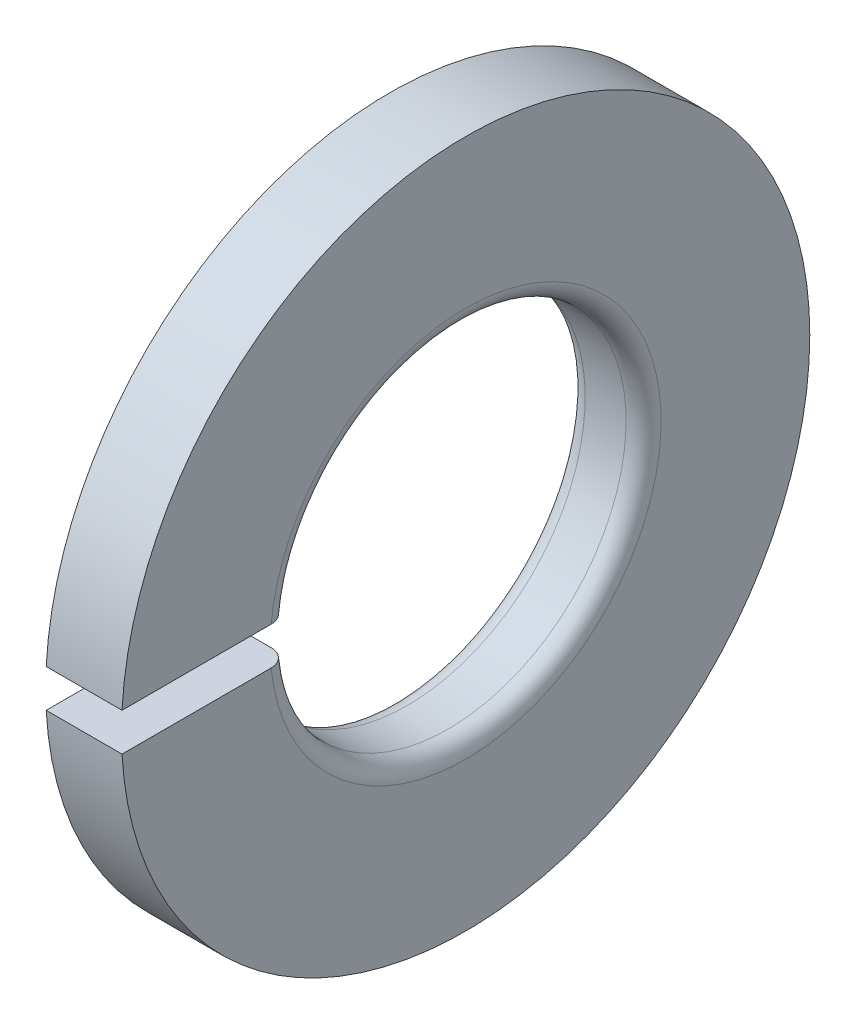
ISO-10303-21;
HEADER;
FILE_DESCRIPTION(('STEP AP214'),'2;1');
FILE_NAME('part.step','',(''),(''),'','','');
FILE_SCHEMA(('AUTOMOTIVE_DESIGN { 1 0 10303 214 1 1 1 1 }'));
ENDSEC;
DATA;
#1=APPLICATION_CONTEXT('core data for automotive mechanical design processes');
#2=APPLICATION_PROTOCOL_DEFINITION('international standard','automotive_design',2000,#1);
#3=PRODUCT_CONTEXT('',#1,'mechanical');
#4=PRODUCT('Part','Part','',(#3));
#5=PRODUCT_RELATED_PRODUCT_CATEGORY('part','',(#4));
#6=PRODUCT_DEFINITION_FORMATION('','',#4);
#7=PRODUCT_DEFINITION_CONTEXT('part definition',#1,'design');
#8=PRODUCT_DEFINITION('design','',#6,#7);
#9=PRODUCT_DEFINITION_SHAPE('','',#8);
#10=(LENGTH_UNIT() NAMED_UNIT(*) SI_UNIT(.MILLI.,.METRE.));
#11=(NAMED_UNIT(*) PLANE_ANGLE_UNIT() SI_UNIT($,.RADIAN.));
#12=(NAMED_UNIT(*) SI_UNIT($,.STERADIAN.) SOLID_ANGLE_UNIT());
#13=UNCERTAINTY_MEASURE_WITH_UNIT(LENGTH_MEASURE(1.E-05),#10,'distance_accuracy_value','');
#14=(GEOMETRIC_REPRESENTATION_CONTEXT(3) GLOBAL_UNCERTAINTY_ASSIGNED_CONTEXT((#13)) GLOBAL_UNIT_ASSIGNED_CONTEXT((#10,
#11,#12)) REPRESENTATION_CONTEXT('',''));
#15=CARTESIAN_POINT('',(0.,0.,0.));
#16=DIRECTION('',(0.,0.,1.));
#17=DIRECTION('',(1.,0.,0.));
#18=AXIS2_PLACEMENT_3D('',#15,#16,#17);
#19=CARTESIAN_POINT('',(-34.9249999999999,0.,0.));
#20=DIRECTION('',(-1.,0.,0.));
#21=DIRECTION('',(0.,0.,1.));
#22=AXIS2_PLACEMENT_3D('',#19,#20,#21);
#23=CYLINDRICAL_SURFACE('',#22,5.9);
#24=DIRECTION('',(-1.,0.,0.));
#25=VECTOR('',#24,1.);
#26=CARTESIAN_POINT('',(-34.925,0.325000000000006,5.89104192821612));
#27=LINE('',#26,#25);
#28=CARTESIAN_POINT('',(0.,0.324999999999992,5.89104192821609));
#29=VERTEX_POINT('',#28);
#30=CARTESIAN_POINT('',(-1.30000000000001,0.325000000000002,5.89104192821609));
#31=VERTEX_POINT('',#30);
#32=EDGE_CURVE('E44',#29,#31,#27,.T.);
#33=ORIENTED_EDGE('',*,*,#32,.F.);
#34=CARTESIAN_POINT('',(0.,0.,0.));
#35=DIRECTION('',(-1.,0.,0.));
#36=DIRECTION('',(0.,0.,1.));
#37=AXIS2_PLACEMENT_3D('',#34,#35,#36);
#38=CIRCLE('',#37,5.9);
#39=CARTESIAN_POINT('',(0.,-0.324999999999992,5.89104192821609));
#40=VERTEX_POINT('',#39);
#41=EDGE_CURVE('E105',#29,#40,#38,.T.);
#42=ORIENTED_EDGE('',*,*,#41,.T.);
#43=DIRECTION('',(-1.,0.,0.));
#44=VECTOR('',#43,1.);
#45=CARTESIAN_POINT('',(-34.925,-0.324999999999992,5.89104192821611));
#46=LINE('',#45,#44);
#47=CARTESIAN_POINT('',(-1.30000000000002,-0.325000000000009,5.89104192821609));
#48=VERTEX_POINT('',#47);
#49=EDGE_CURVE('E86',#48,#40,#46,.F.);
#50=ORIENTED_EDGE('',*,*,#49,.F.);
#51=CARTESIAN_POINT('',(-1.3,0.,0.));
#52=DIRECTION('',(-1.,0.,0.));
#53=DIRECTION('',(0.,0.,1.));
#54=AXIS2_PLACEMENT_3D('',#51,#52,#53);
#55=CIRCLE('',#54,5.9);
#56=EDGE_CURVE('E117',#31,#48,#55,.T.);
#57=ORIENTED_EDGE('',*,*,#56,.F.);
#58=EDGE_LOOP('',(#33,#42,#50,#57));
#59=FACE_BOUND('',#58,.T.);
#60=ADVANCED_FACE('F31',(#59),#23,.T.);
#61=CARTESIAN_POINT('',(0.,3.34999999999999,0.));
#62=DIRECTION('',(-1.,0.,0.));
#63=DIRECTION('',(0.,0.,1.));
#64=AXIS2_PLACEMENT_3D('',#61,#62,#63);
#65=PLANE('',#64);
#66=DIRECTION('',(0.,0.,-1.));
#67=VECTOR('',#66,1.);
#68=CARTESIAN_POINT('',(0.,0.324999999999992,6.018));
#69=LINE('',#68,#67);
#70=CARTESIAN_POINT('',(0.,0.324999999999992,3.33419780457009));
#71=VERTEX_POINT('',#70);
#72=EDGE_CURVE('E91',#29,#71,#69,.T.);
#73=ORIENTED_EDGE('',*,*,#72,.T.);
#74=CARTESIAN_POINT('',(0.,0.,0.));
#75=DIRECTION('',(-1.,0.,0.));
#76=DIRECTION('',(0.,0.,1.));
#77=AXIS2_PLACEMENT_3D('',#74,#75,#76);
#78=CIRCLE('',#77,3.35);
#79=CARTESIAN_POINT('',(0.,-0.325000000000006,3.33419780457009));
#80=VERTEX_POINT('',#79);
#81=EDGE_CURVE('E98',#71,#80,#78,.T.);
#82=ORIENTED_EDGE('',*,*,#81,.T.);
#83=DIRECTION('',(0.,0.,1.));
#84=VECTOR('',#83,1.);
#85=CARTESIAN_POINT('',(0.,-0.324999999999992,0.));
#86=LINE('',#85,#84);
#87=EDGE_CURVE('E80',#80,#40,#86,.T.);
#88=ORIENTED_EDGE('',*,*,#87,.T.);
#89=ORIENTED_EDGE('',*,*,#41,.F.);
#90=EDGE_LOOP('',(#73,#82,#88,#89));
#91=FACE_BOUND('',#90,.T.);
#92=ADVANCED_FACE('F104',(#91),#65,.F.);
#93=CARTESIAN_POINT('',(-0.300000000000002,0.,0.));
#94=DIRECTION('',(-1.,0.,0.));
#95=DIRECTION('',(0.,0.,1.));
#96=AXIS2_PLACEMENT_3D('',#93,#94,#95);
#97=TOROIDAL_SURFACE('',#96,3.35,0.3);
#98=ORIENTED_EDGE('',*,*,#81,.F.);
#99=CARTESIAN_POINT('',(-0.164784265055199,0.324999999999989,3.06501768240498));
#100=CARTESIAN_POINT('',(-0.179742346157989,0.324999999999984,3.05742363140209));
#101=CARTESIAN_POINT('',(-0.195350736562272,0.325000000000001,3.05108422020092));
#102=CARTESIAN_POINT('',(-0.227422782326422,0.325000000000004,3.04111000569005));
#103=CARTESIAN_POINT('',(-0.243887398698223,0.32499999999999,3.03747831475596));
#104=CARTESIAN_POINT('',(-0.277188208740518,0.324999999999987,3.03303503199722));
#105=CARTESIAN_POINT('',(-0.294024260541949,0.324999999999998,3.03222238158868));
#106=CARTESIAN_POINT('',(-0.327588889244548,0.325000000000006,3.03343923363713));
#107=CARTESIAN_POINT('',(-0.344317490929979,0.325000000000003,3.03546805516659));
#108=CARTESIAN_POINT('',(-0.377179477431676,0.325000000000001,3.0423029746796));
#109=CARTESIAN_POINT('',(-0.393313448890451,0.325000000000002,3.04710625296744));
#110=CARTESIAN_POINT('',(-0.42454921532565,0.325000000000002,3.05934757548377));
#111=CARTESIAN_POINT('',(-0.439650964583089,0.325000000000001,3.06678573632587));
#112=CARTESIAN_POINT('',(-0.468430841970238,0.325000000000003,3.08410032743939));
#113=CARTESIAN_POINT('',(-0.482105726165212,0.325000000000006,3.09398214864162));
#114=CARTESIAN_POINT('',(-0.507612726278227,0.324999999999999,3.11589092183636));
#115=CARTESIAN_POINT('',(-0.519444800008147,0.324999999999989,3.12791792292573));
#116=CARTESIAN_POINT('',(-0.540992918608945,0.324999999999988,3.15383855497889));
#117=CARTESIAN_POINT('',(-0.550698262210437,0.324999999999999,3.16774108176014));
#118=CARTESIAN_POINT('',(-0.56765078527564,0.325000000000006,3.19697169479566));
#119=CARTESIAN_POINT('',(-0.574897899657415,0.325000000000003,3.21229981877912));
#120=CARTESIAN_POINT('',(-0.586764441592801,0.325000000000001,3.24402866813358));
#121=CARTESIAN_POINT('',(-0.591370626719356,0.325000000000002,3.2604343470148));
#122=CARTESIAN_POINT('',(-0.597771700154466,0.325000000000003,3.29378538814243));
#123=CARTESIAN_POINT('',(-0.599566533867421,0.325000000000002,3.31073076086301));
#124=CARTESIAN_POINT('',(-0.600295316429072,0.325000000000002,3.34472882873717));
#125=CARTESIAN_POINT('',(-0.599221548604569,0.325000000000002,3.36178169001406));
#126=CARTESIAN_POINT('',(-0.594225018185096,0.325000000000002,3.39546495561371));
#127=CARTESIAN_POINT('',(-0.590302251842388,0.325000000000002,3.41209535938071));
#128=CARTESIAN_POINT('',(-0.579718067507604,0.325000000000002,3.44445169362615));
#129=CARTESIAN_POINT('',(-0.573058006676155,0.325000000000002,3.46017806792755));
#130=CARTESIAN_POINT('',(-0.557184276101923,0.325000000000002,3.49028461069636));
#131=CARTESIAN_POINT('',(-0.547970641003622,0.325000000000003,3.50466479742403));
#132=CARTESIAN_POINT('',(-0.527280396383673,0.325000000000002,3.53162248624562));
#133=CARTESIAN_POINT('',(-0.515810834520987,0.325000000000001,3.5442053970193));
#134=CARTESIAN_POINT('',(-0.490914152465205,0.325000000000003,3.56725714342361));
#135=CARTESIAN_POINT('',(-0.477487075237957,0.325000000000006,3.57772602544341));
#136=CARTESIAN_POINT('',(-0.449116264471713,0.325000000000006,3.59620651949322));
#137=CARTESIAN_POINT('',(-0.43417905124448,0.325000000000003,3.60422814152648));
#138=CARTESIAN_POINT('',(-0.403166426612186,0.325000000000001,3.61763942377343));
#139=CARTESIAN_POINT('',(-0.387091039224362,0.325000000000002,3.62302913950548));
#140=CARTESIAN_POINT('',(-0.354320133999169,0.325000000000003,3.63100501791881));
#141=CARTESIAN_POINT('',(-0.337627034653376,0.325000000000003,3.63360111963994));
#142=CARTESIAN_POINT('',(-0.304042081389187,0.325000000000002,3.63594848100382));
#143=CARTESIAN_POINT('',(-0.287150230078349,0.325000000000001,3.63569977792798));
#144=CARTESIAN_POINT('',(-0.25367856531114,0.325000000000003,3.63236778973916));
#145=CARTESIAN_POINT('',(-0.237098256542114,0.325000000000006,3.62928947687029));
#146=CARTESIAN_POINT('',(-0.204689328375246,0.324999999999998,3.62039456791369));
#147=CARTESIAN_POINT('',(-0.188860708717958,0.324999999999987,3.6145779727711));
#148=CARTESIAN_POINT('',(-0.158392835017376,0.32499999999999,3.6003700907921));
#149=CARTESIAN_POINT('',(-0.143754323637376,0.325000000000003,3.59197721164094));
#150=CARTESIAN_POINT('',(-0.116089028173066,0.325000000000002,3.57285944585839));
#151=CARTESIAN_POINT('',(-0.103062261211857,0.324999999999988,3.56213453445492));
#152=CARTESIAN_POINT('',(-0.0789502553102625,0.324999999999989,3.53862634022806));
#153=CARTESIAN_POINT('',(-0.0678705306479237,0.325000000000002,3.52583740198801));
#154=CARTESIAN_POINT('',(-0.0480051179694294,0.325000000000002,3.49858727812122));
#155=CARTESIAN_POINT('',(-0.0392194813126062,0.324999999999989,3.48412605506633));
#156=CARTESIAN_POINT('',(-0.024153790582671,0.324999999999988,3.45387956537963));
#157=CARTESIAN_POINT('',(-0.0178839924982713,0.325000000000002,3.43808919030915));
#158=CARTESIAN_POINT('',(-0.00807297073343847,0.325000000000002,3.40568235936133));
#159=CARTESIAN_POINT('',(-0.00453181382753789,0.324999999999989,3.38906588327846));
#160=CARTESIAN_POINT('',(-0.000266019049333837,0.324999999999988,3.35541030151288));
#161=CARTESIAN_POINT('',(0.00044775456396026,0.325000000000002,3.33836981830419));
#162=CARTESIAN_POINT('',(-0.000989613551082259,0.325000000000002,3.3044106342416));
#163=CARTESIAN_POINT('',(-0.00314068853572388,0.324999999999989,3.28749193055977));
#164=CARTESIAN_POINT('',(-0.0102538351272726,0.324999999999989,3.25422315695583));
#165=CARTESIAN_POINT('',(-0.0152211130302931,0.325000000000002,3.23787419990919));
#166=CARTESIAN_POINT('',(-0.0278343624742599,0.325000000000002,3.2062390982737));
#167=CARTESIAN_POINT('',(-0.0354809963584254,0.324999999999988,3.1909532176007));
#168=CARTESIAN_POINT('',(-0.0532322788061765,0.324999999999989,3.16189667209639));
#169=CARTESIAN_POINT('',(-0.0633354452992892,0.325000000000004,3.14812510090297));
#170=CARTESIAN_POINT('',(-0.0857124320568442,0.325000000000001,3.12249558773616));
#171=CARTESIAN_POINT('',(-0.0979835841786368,0.324999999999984,3.11063532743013));
#172=CARTESIAN_POINT('',(-0.119442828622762,0.324999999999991,3.09315407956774));
#173=CARTESIAN_POINT('',(-0.128084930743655,0.325000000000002,3.08685111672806));
#174=CARTESIAN_POINT('',(-0.145991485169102,0.325000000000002,3.07520163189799));
#175=CARTESIAN_POINT('',(-0.155255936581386,0.324999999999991,3.06985510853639));
#176=CARTESIAN_POINT('',(-0.164784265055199,0.324999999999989,3.06501768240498));
#177=B_SPLINE_CURVE_WITH_KNOTS('',3,(#99,#100,#101,#102,#103,#104,#105,#106,#107,#108,#109,#110,
#111,#112,#113,#114,#115,#116,#117,#118,#119,#120,#121,#122,#123,#124,#125,#126,#127,#128,#129,
#130,#131,#132,#133,#134,#135,#136,#137,#138,#139,#140,#141,#142,#143,#144,#145,#146,#147,#148,
#149,#150,#151,#152,#153,#154,#155,#156,#157,#158,#159,#160,#161,#162,#163,#164,#165,#166,#167,
#168,#169,#170,#171,#172,#173,#174,#175,#176),.UNSPECIFIED.,.T.,.F.,(4,2,2,2,2,2,2,2,2,2,2,2,2,
2,2,2,2,2,2,2,2,2,2,2,2,2,2,2,2,2,2,2,2,2,2,2,2,2,4),(0.,0.0502873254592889,0.100632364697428,
0.150958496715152,0.201272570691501,0.251535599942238,0.301800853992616,0.352178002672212,
0.402556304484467,0.453182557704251,0.50381015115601,0.554689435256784,0.60556970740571,
0.656586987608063,0.707604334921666,0.75859641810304,0.8095878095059,0.860422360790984,
0.911255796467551,0.961878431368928,1.01249999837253,1.06294086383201,1.11338106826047,
1.16373280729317,1.21408452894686,1.2644674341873,1.31485087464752,1.36537478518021,
1.41589982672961,1.46662879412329,1.51735900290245,1.56828395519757,1.61920772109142,
1.67022593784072,1.72125677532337,1.77225690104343,1.82319469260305,1.85522786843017,
1.88726099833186),.UNSPECIFIED.);
#178=CARTESIAN_POINT('',(-0.300000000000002,0.325000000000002,3.03263499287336));
#179=VERTEX_POINT('',#178);
#180=EDGE_CURVE('E124',#71,#179,#177,.T.);
#181=ORIENTED_EDGE('',*,*,#180,.T.);
#182=CARTESIAN_POINT('',(-0.300000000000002,0.,0.));
#183=DIRECTION('',(-1.,0.,0.));
#184=DIRECTION('',(0.,0.,1.));
#185=AXIS2_PLACEMENT_3D('',#182,#183,#184);
#186=CIRCLE('',#185,3.05);
#187=CARTESIAN_POINT('',(-0.300000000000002,-0.325000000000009,3.03263499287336));
#188=VERTEX_POINT('',#187);
#189=EDGE_CURVE('E100',#179,#188,#186,.T.);
#190=ORIENTED_EDGE('',*,*,#189,.T.);
#191=CARTESIAN_POINT('',(-0.164784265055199,-0.325000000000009,3.06501768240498));
#192=CARTESIAN_POINT('',(-0.149728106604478,-0.325000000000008,3.07266322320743));
#193=CARTESIAN_POINT('',(-0.135308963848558,-0.32500000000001,3.08159122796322));
#194=CARTESIAN_POINT('',(-0.108165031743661,-0.325000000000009,3.10175231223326));
#195=CARTESIAN_POINT('',(-0.095442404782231,-0.325000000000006,3.11298828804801));
#196=CARTESIAN_POINT('',(-0.0720695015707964,-0.325000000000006,3.13742740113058));
#197=CARTESIAN_POINT('',(-0.0614177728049,-0.325000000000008,3.15062914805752));
#198=CARTESIAN_POINT('',(-0.0424750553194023,-0.32500000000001,3.17862396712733));
#199=CARTESIAN_POINT('',(-0.0341834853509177,-0.32500000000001,3.19341664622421));
#200=CARTESIAN_POINT('',(-0.0201577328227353,-0.325000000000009,3.22423781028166));
#201=CARTESIAN_POINT('',(-0.0144335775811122,-0.325000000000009,3.24027085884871));
#202=CARTESIAN_POINT('',(-0.00574796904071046,-0.325000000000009,3.27306934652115));
#203=CARTESIAN_POINT('',(-0.00278668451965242,-0.325000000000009,3.28983483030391));
#204=CARTESIAN_POINT('',(0.000295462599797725,-0.325000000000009,3.3236805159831));
#205=CARTESIAN_POINT('',(0.000406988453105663,-0.32500000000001,3.34076156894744));
#206=CARTESIAN_POINT('',(-0.00223854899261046,-0.325000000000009,3.37470019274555));
#207=CARTESIAN_POINT('',(-0.00499562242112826,-0.325000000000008,3.39155776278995));
#208=CARTESIAN_POINT('',(-0.0133039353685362,-0.32500000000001,3.42457275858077));
#209=CARTESIAN_POINT('',(-0.0188556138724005,-0.325000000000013,3.44073007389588));
#210=CARTESIAN_POINT('',(-0.0325998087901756,-0.325000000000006,3.4718796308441));
#211=CARTESIAN_POINT('',(-0.0407922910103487,-0.324999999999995,3.48687188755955));
#212=CARTESIAN_POINT('',(-0.0595639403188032,-0.324999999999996,3.51522217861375));
#213=CARTESIAN_POINT('',(-0.0701367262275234,-0.325000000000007,3.52858443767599));
#214=CARTESIAN_POINT('',(-0.0933839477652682,-0.325000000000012,3.55333516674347));
#215=CARTESIAN_POINT('',(-0.106058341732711,-0.325000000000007,3.56472367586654));
#216=CARTESIAN_POINT('',(-0.133093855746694,-0.325000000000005,3.58515414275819));
#217=CARTESIAN_POINT('',(-0.147447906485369,-0.325000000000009,3.59420545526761));
#218=CARTESIAN_POINT('',(-0.177476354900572,-0.32500000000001,3.60975901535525));
#219=CARTESIAN_POINT('',(-0.193150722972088,-0.325000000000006,3.61626132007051));
#220=CARTESIAN_POINT('',(-0.225310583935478,-0.325000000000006,3.62650750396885));
#221=CARTESIAN_POINT('',(-0.241792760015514,-0.325000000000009,3.63026179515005));
#222=CARTESIAN_POINT('',(-0.275153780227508,-0.325000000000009,3.63494317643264));
#223=CARTESIAN_POINT('',(-0.292032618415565,-0.325000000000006,3.63587030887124));
#224=CARTESIAN_POINT('',(-0.325668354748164,-0.325000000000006,3.63487154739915));
#225=CARTESIAN_POINT('',(-0.342425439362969,-0.325000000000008,3.63295191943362));
#226=CARTESIAN_POINT('',(-0.375379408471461,-0.32500000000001,3.626326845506));
#227=CARTESIAN_POINT('',(-0.391576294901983,-0.32500000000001,3.62162140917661));
#228=CARTESIAN_POINT('',(-0.422953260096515,-0.325000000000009,3.60956017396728));
#229=CARTESIAN_POINT('',(-0.438133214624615,-0.325000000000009,3.60220405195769));
#230=CARTESIAN_POINT('',(-0.467046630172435,-0.325000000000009,3.5850535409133));
#231=CARTESIAN_POINT('',(-0.480780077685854,-0.325000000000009,3.57525912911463));
#232=CARTESIAN_POINT('',(-0.506447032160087,-0.325000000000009,3.55348642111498));
#233=CARTESIAN_POINT('',(-0.518376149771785,-0.325000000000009,3.54150295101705));
#234=CARTESIAN_POINT('',(-0.540062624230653,-0.325000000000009,3.51571018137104));
#235=CARTESIAN_POINT('',(-0.549819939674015,-0.325000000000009,3.50190084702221));
#236=CARTESIAN_POINT('',(-0.566926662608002,-0.325000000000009,3.47279122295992));
#237=CARTESIAN_POINT('',(-0.574266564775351,-0.32500000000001,3.45748534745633));
#238=CARTESIAN_POINT('',(-0.586284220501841,-0.325000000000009,3.42586195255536));
#239=CARTESIAN_POINT('',(-0.59096191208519,-0.325000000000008,3.40954440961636));
#240=CARTESIAN_POINT('',(-0.597540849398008,-0.32500000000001,3.37629092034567));
#241=CARTESIAN_POINT('',(-0.599430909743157,-0.325000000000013,3.35935276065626));
#242=CARTESIAN_POINT('',(-0.600348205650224,-0.325000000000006,3.32539902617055));
#243=CARTESIAN_POINT('',(-0.599375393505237,-0.324999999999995,3.30838345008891));
#244=CARTESIAN_POINT('',(-0.594588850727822,-0.324999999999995,3.27471364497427));
#245=CARTESIAN_POINT('',(-0.590768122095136,-0.325000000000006,3.25806041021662));
#246=CARTESIAN_POINT('',(-0.580384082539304,-0.325000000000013,3.22563190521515));
#247=CARTESIAN_POINT('',(-0.573820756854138,-0.325000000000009,3.20985663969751));
#248=CARTESIAN_POINT('',(-0.558137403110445,-0.325000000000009,3.17964068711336));
#249=CARTESIAN_POINT('',(-0.549018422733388,-0.325000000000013,3.16519945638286));
#250=CARTESIAN_POINT('',(-0.528477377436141,-0.325000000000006,3.13805980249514));
#251=CARTESIAN_POINT('',(-0.517055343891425,-0.324999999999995,3.12536135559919));
#252=CARTESIAN_POINT('',(-0.492273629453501,-0.324999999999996,3.1021172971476));
#253=CARTESIAN_POINT('',(-0.478920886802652,-0.325000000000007,3.09156428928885));
#254=CARTESIAN_POINT('',(-0.450625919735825,-0.325000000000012,3.07286429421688));
#255=CARTESIAN_POINT('',(-0.435683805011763,-0.325000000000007,3.06471714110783));
#256=CARTESIAN_POINT('',(-0.404719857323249,-0.325000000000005,3.05110556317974));
#257=CARTESIAN_POINT('',(-0.388704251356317,-0.325000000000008,3.04562697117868));
#258=CARTESIAN_POINT('',(-0.355973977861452,-0.32500000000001,3.03744845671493));
#259=CARTESIAN_POINT('',(-0.339259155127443,-0.325000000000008,3.03474915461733));
#260=CARTESIAN_POINT('',(-0.305680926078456,-0.32500000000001,3.03221585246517));
#261=CARTESIAN_POINT('',(-0.288818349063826,-0.325000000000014,3.03237076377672));
#262=CARTESIAN_POINT('',(-0.25537394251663,-0.325000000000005,3.03551516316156));
#263=CARTESIAN_POINT('',(-0.23879179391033,-0.324999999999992,3.03850117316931));
#264=CARTESIAN_POINT('',(-0.212603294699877,-0.324999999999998,3.04553409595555));
#265=CARTESIAN_POINT('',(-0.202761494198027,-0.325000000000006,3.04873441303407));
#266=CARTESIAN_POINT('',(-0.183461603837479,-0.325000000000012,3.05613543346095));
#267=CARTESIAN_POINT('',(-0.174003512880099,-0.32500000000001,3.06033613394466));
#268=CARTESIAN_POINT('',(-0.164784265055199,-0.325000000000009,3.06501768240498));
#269=B_SPLINE_CURVE_WITH_KNOTS('',3,(#191,#192,#193,#194,#195,#196,#197,#198,#199,#200,#201,
#202,#203,#204,#205,#206,#207,#208,#209,#210,#211,#212,#213,#214,#215,#216,#217,#218,#219,#220,
#221,#222,#223,#224,#225,#226,#227,#228,#229,#230,#231,#232,#233,#234,#235,#236,#237,#238,#239,
#240,#241,#242,#243,#244,#245,#246,#247,#248,#249,#250,#251,#252,#253,#254,#255,#256,#257,#258,
#259,#260,#261,#262,#263,#264,#265,#266,#267,#268),.UNSPECIFIED.,.T.,.F.,(4,2,2,2,2,2,2,2,2,2,2,
2,2,2,2,2,2,2,2,2,2,2,2,2,2,2,2,2,2,2,2,2,2,2,2,2,2,2,4),(0.,0.0506204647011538,
0.101304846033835,0.151953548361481,0.202589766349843,0.253422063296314,0.304257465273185,
0.355259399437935,0.406261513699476,0.457271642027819,0.508281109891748,0.559155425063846,
0.610028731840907,0.660695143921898,0.71136042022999,0.761832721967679,0.81230426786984,
0.862664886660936,0.913025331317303,0.963391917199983,1.01375897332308,1.0642466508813,
1.11473529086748,1.1654201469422,1.21610618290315,1.26699504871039,1.31788476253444,
1.36889993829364,1.4199153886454,1.47090995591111,1.52190382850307,1.57271880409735,
1.62353027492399,1.67406896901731,1.72461894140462,1.77497256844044,1.82526441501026,
1.85626063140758,1.88725675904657),.UNSPECIFIED.);
#270=EDGE_CURVE('E83',#188,#80,#269,.T.);
#271=ORIENTED_EDGE('',*,*,#270,.T.);
#272=EDGE_LOOP('',(#98,#181,#190,#271));
#273=FACE_BOUND('',#272,.T.);
#274=ADVANCED_FACE('F96',(#273),#97,.T.);
#275=CARTESIAN_POINT('',(-34.9249999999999,0.,0.));
#276=DIRECTION('',(-1.,0.,0.));
#277=DIRECTION('',(0.,0.,1.));
#278=AXIS2_PLACEMENT_3D('',#275,#276,#277);
#279=CYLINDRICAL_SURFACE('',#278,3.05);
#280=DIRECTION('',(-1.,0.,0.));
#281=VECTOR('',#280,1.);
#282=CARTESIAN_POINT('',(-34.9249999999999,0.325000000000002,3.03263499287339));
#283=LINE('',#282,#281);
#284=CARTESIAN_POINT('',(-0.999999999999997,0.325000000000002,3.03263499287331));
#285=VERTEX_POINT('',#284);
#286=EDGE_CURVE('E132',#285,#179,#283,.F.);
#287=ORIENTED_EDGE('',*,*,#286,.F.);
#288=CARTESIAN_POINT('',(-1.,0.,0.));
#289=DIRECTION('',(-1.,0.,0.));
#290=DIRECTION('',(0.,0.,1.));
#291=AXIS2_PLACEMENT_3D('',#288,#289,#290);
#292=CIRCLE('',#291,3.05);
#293=CARTESIAN_POINT('',(-1.0000000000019,-0.324999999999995,3.0326349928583));
#294=VERTEX_POINT('',#293);
#295=EDGE_CURVE('E108',#285,#294,#292,.T.);
#296=ORIENTED_EDGE('',*,*,#295,.T.);
#297=DIRECTION('',(-1.,0.,0.));
#298=VECTOR('',#297,1.);
#299=CARTESIAN_POINT('',(-34.925,-0.324999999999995,3.03263499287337));
#300=LINE('',#299,#298);
#301=EDGE_CURVE('E101',#188,#294,#300,.T.);
#302=ORIENTED_EDGE('',*,*,#301,.F.);
#303=ORIENTED_EDGE('',*,*,#189,.F.);
#304=EDGE_LOOP('',(#287,#296,#302,#303));
#305=FACE_BOUND('',#304,.T.);
#306=ADVANCED_FACE('F131',(#305),#279,.F.);
#307=CARTESIAN_POINT('',(-1.,0.,0.));
#308=DIRECTION('',(-1.,0.,0.));
#309=DIRECTION('',(0.,0.,1.));
#310=AXIS2_PLACEMENT_3D('',#307,#308,#309);
#311=TOROIDAL_SURFACE('',#310,3.35,0.3);
#312=ORIENTED_EDGE('',*,*,#295,.F.);
#313=CARTESIAN_POINT('',(-1.1352157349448,0.325000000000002,3.06501768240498));
#314=CARTESIAN_POINT('',(-1.15027189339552,0.325000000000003,3.07266322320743));
#315=CARTESIAN_POINT('',(-1.16469103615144,0.325000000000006,3.08159122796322));
#316=CARTESIAN_POINT('',(-1.19183496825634,0.324999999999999,3.10175231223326));
#317=CARTESIAN_POINT('',(-1.20455759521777,0.324999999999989,3.11298828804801));
#318=CARTESIAN_POINT('',(-1.2279304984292,0.324999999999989,3.13742740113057));
#319=CARTESIAN_POINT('',(-1.2385822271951,0.324999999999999,3.15062914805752));
#320=CARTESIAN_POINT('',(-1.2575249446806,0.325000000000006,3.17862396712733));
#321=CARTESIAN_POINT('',(-1.26581651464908,0.325000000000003,3.19341664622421));
#322=CARTESIAN_POINT('',(-1.27984226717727,0.325000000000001,3.22423781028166));
#323=CARTESIAN_POINT('',(-1.28556642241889,0.325000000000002,3.24027085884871));
#324=CARTESIAN_POINT('',(-1.29425203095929,0.325000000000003,3.27306934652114));
#325=CARTESIAN_POINT('',(-1.29721331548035,0.325000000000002,3.28983483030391));
#326=CARTESIAN_POINT('',(-1.3002954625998,0.325000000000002,3.3236805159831));
#327=CARTESIAN_POINT('',(-1.30040698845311,0.325000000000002,3.34076156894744));
#328=CARTESIAN_POINT('',(-1.29776145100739,0.325000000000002,3.37470019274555));
#329=CARTESIAN_POINT('',(-1.29500437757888,0.325000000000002,3.39155776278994));
#330=CARTESIAN_POINT('',(-1.28669606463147,0.325000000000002,3.42457275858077));
#331=CARTESIAN_POINT('',(-1.2811443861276,0.325000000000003,3.44073007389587));
#332=CARTESIAN_POINT('',(-1.26740019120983,0.325000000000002,3.4718796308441));
#333=CARTESIAN_POINT('',(-1.25920770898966,0.325000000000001,3.48687188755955));
#334=CARTESIAN_POINT('',(-1.2404360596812,0.325000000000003,3.51522217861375));
#335=CARTESIAN_POINT('',(-1.22986327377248,0.325000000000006,3.52858443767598));
#336=CARTESIAN_POINT('',(-1.20661605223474,0.324999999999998,3.55333516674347));
#337=CARTESIAN_POINT('',(-1.19394165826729,0.324999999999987,3.56472367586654));
#338=CARTESIAN_POINT('',(-1.16690614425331,0.32499999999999,3.58515414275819));
#339=CARTESIAN_POINT('',(-1.15255209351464,0.325000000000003,3.59420545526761));
#340=CARTESIAN_POINT('',(-1.12252364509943,0.325000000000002,3.60975901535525));
#341=CARTESIAN_POINT('',(-1.10684927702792,0.324999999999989,3.61626132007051));
#342=CARTESIAN_POINT('',(-1.07468941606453,0.324999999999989,3.62650750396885));
#343=CARTESIAN_POINT('',(-1.05820723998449,0.325000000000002,3.63026179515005));
#344=CARTESIAN_POINT('',(-1.0248462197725,0.325000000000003,3.63494317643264));
#345=CARTESIAN_POINT('',(-1.00796738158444,0.32499999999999,3.63587030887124));
#346=CARTESIAN_POINT('',(-0.974331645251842,0.324999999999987,3.63487154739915));
#347=CARTESIAN_POINT('',(-0.957574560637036,0.324999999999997,3.63295191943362));
#348=CARTESIAN_POINT('',(-0.924620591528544,0.325000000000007,3.626326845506));
#349=CARTESIAN_POINT('',(-0.908423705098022,0.325000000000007,3.62162140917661));
#350=CARTESIAN_POINT('',(-0.877046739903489,0.325000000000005,3.60956017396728));
#351=CARTESIAN_POINT('',(-0.86186678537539,0.325000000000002,3.60220405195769));
#352=CARTESIAN_POINT('',(-0.832953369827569,0.325000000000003,3.58505354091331));
#353=CARTESIAN_POINT('',(-0.81921992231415,0.325000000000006,3.57525912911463));
#354=CARTESIAN_POINT('',(-0.793552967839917,0.325000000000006,3.55348642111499));
#355=CARTESIAN_POINT('',(-0.78162385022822,0.325000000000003,3.54150295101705));
#356=CARTESIAN_POINT('',(-0.759937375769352,0.325000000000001,3.51571018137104));
#357=CARTESIAN_POINT('',(-0.75018006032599,0.325000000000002,3.50190084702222));
#358=CARTESIAN_POINT('',(-0.733073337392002,0.325000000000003,3.47279122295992));
#359=CARTESIAN_POINT('',(-0.725733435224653,0.325000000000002,3.45748534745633));
#360=CARTESIAN_POINT('',(-0.713715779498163,0.325000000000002,3.42586195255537));
#361=CARTESIAN_POINT('',(-0.709038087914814,0.325000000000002,3.40954440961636));
#362=CARTESIAN_POINT('',(-0.702459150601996,0.325000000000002,3.37629092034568));
#363=CARTESIAN_POINT('',(-0.700569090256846,0.325000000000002,3.35935276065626));
#364=CARTESIAN_POINT('',(-0.699651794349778,0.325000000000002,3.32539902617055));
#365=CARTESIAN_POINT('',(-0.700624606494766,0.325000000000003,3.30838345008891));
#366=CARTESIAN_POINT('',(-0.70541114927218,0.325000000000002,3.27471364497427));
#367=CARTESIAN_POINT('',(-0.709231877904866,0.325000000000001,3.25806041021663));
#368=CARTESIAN_POINT('',(-0.719615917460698,0.325000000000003,3.22563190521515));
#369=CARTESIAN_POINT('',(-0.726179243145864,0.325000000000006,3.20985663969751));
#370=CARTESIAN_POINT('',(-0.741862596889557,0.325000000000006,3.17964068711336));
#371=CARTESIAN_POINT('',(-0.750981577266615,0.325000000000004,3.16519945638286));
#372=CARTESIAN_POINT('',(-0.771522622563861,0.325000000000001,3.13805980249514));
#373=CARTESIAN_POINT('',(-0.782944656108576,0.325000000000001,3.12536135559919));
#374=CARTESIAN_POINT('',(-0.807726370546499,0.325000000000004,3.1021172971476));
#375=CARTESIAN_POINT('',(-0.82107911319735,0.325000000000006,3.09156428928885));
#376=CARTESIAN_POINT('',(-0.849374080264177,0.324999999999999,3.07286429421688));
#377=CARTESIAN_POINT('',(-0.864316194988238,0.324999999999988,3.06471714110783));
#378=CARTESIAN_POINT('',(-0.895280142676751,0.324999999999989,3.05110556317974));
#379=CARTESIAN_POINT('',(-0.911295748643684,0.324999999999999,3.04562697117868));
#380=CARTESIAN_POINT('',(-0.944026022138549,0.325000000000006,3.03744845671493));
#381=CARTESIAN_POINT('',(-0.960740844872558,0.325000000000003,3.03474915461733));
#382=CARTESIAN_POINT('',(-0.994319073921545,0.325000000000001,3.03221585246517));
#383=CARTESIAN_POINT('',(-1.01118165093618,0.325000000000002,3.03237076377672));
#384=CARTESIAN_POINT('',(-1.04462605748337,0.325000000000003,3.03551516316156));
#385=CARTESIAN_POINT('',(-1.06120820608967,0.325000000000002,3.03850117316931));
#386=CARTESIAN_POINT('',(-1.08739670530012,0.325000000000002,3.04553409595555));
#387=CARTESIAN_POINT('',(-1.09723850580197,0.325000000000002,3.04873441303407));
#388=CARTESIAN_POINT('',(-1.11653839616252,0.325000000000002,3.05613543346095));
#389=CARTESIAN_POINT('',(-1.1259964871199,0.325000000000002,3.06033613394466));
#390=CARTESIAN_POINT('',(-1.1352157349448,0.325000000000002,3.06501768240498));
#391=B_SPLINE_CURVE_WITH_KNOTS('',3,(#313,#314,#315,#316,#317,#318,#319,#320,#321,#322,#323,
#324,#325,#326,#327,#328,#329,#330,#331,#332,#333,#334,#335,#336,#337,#338,#339,#340,#341,#342,
#343,#344,#345,#346,#347,#348,#349,#350,#351,#352,#353,#354,#355,#356,#357,#358,#359,#360,#361,
#362,#363,#364,#365,#366,#367,#368,#369,#370,#371,#372,#373,#374,#375,#376,#377,#378,#379,#380,
#381,#382,#383,#384,#385,#386,#387,#388,#389,#390),.UNSPECIFIED.,.T.,.F.,(4,2,2,2,2,2,2,2,2,2,2,
2,2,2,2,2,2,2,2,2,2,2,2,2,2,2,2,2,2,2,2,2,2,2,2,2,2,2,4),(0.,0.0506204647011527,
0.101304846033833,0.151953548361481,0.202589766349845,0.253422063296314,0.304257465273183,
0.355259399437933,0.406261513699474,0.457271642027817,0.508281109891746,0.559155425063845,
0.610028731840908,0.660695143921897,0.711360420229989,0.761832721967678,0.812304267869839,
0.862664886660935,0.913025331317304,0.963391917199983,1.01375897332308,1.0642466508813,
1.11473529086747,1.1654201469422,1.21610618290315,1.26699504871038,1.31788476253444,
1.36889993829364,1.41991538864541,1.47090995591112,1.52190382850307,1.57271880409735,
1.62353027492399,1.67406896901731,1.72461894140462,1.77497256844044,1.82526441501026,
1.85626063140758,1.88725675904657),.UNSPECIFIED.);
#392=CARTESIAN_POINT('',(-1.3,0.324999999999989,3.33419780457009));
#393=VERTEX_POINT('',#392);
#394=EDGE_CURVE('E118',#285,#393,#391,.T.);
#395=ORIENTED_EDGE('',*,*,#394,.T.);
#396=CARTESIAN_POINT('',(-1.3,0.,0.));
#397=DIRECTION('',(-1.,0.,0.));
#398=DIRECTION('',(0.,0.,1.));
#399=AXIS2_PLACEMENT_3D('',#396,#397,#398);
#400=CIRCLE('',#399,3.35);
#401=CARTESIAN_POINT('',(-1.3,-0.325000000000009,3.33419780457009));
#402=VERTEX_POINT('',#401);
#403=EDGE_CURVE('E121',#393,#402,#400,.T.);
#404=ORIENTED_EDGE('',*,*,#403,.T.);
#405=CARTESIAN_POINT('',(-1.1352157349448,-0.324999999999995,3.06501768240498));
#406=CARTESIAN_POINT('',(-1.12025765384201,-0.324999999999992,3.05742363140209));
#407=CARTESIAN_POINT('',(-1.10464926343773,-0.325000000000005,3.05108422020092));
#408=CARTESIAN_POINT('',(-1.07257721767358,-0.325000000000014,3.04111000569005));
#409=CARTESIAN_POINT('',(-1.05611260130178,-0.325000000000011,3.03747831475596));
#410=CARTESIAN_POINT('',(-1.02281179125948,-0.325000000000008,3.03303503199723));
#411=CARTESIAN_POINT('',(-1.00597573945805,-0.325000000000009,3.03222238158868));
#412=CARTESIAN_POINT('',(-0.972411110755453,-0.32500000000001,3.03343923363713));
#413=CARTESIAN_POINT('',(-0.955682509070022,-0.325000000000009,3.03546805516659));
#414=CARTESIAN_POINT('',(-0.922820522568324,-0.325000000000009,3.0423029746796));
#415=CARTESIAN_POINT('',(-0.906686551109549,-0.325000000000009,3.04710625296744));
#416=CARTESIAN_POINT('',(-0.875450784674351,-0.325000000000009,3.05934757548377));
#417=CARTESIAN_POINT('',(-0.860349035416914,-0.325000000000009,3.06678573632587));
#418=CARTESIAN_POINT('',(-0.831569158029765,-0.325000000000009,3.0841003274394));
#419=CARTESIAN_POINT('',(-0.81789427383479,-0.325000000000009,3.09398214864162));
#420=CARTESIAN_POINT('',(-0.792387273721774,-0.325000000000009,3.11589092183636));
#421=CARTESIAN_POINT('',(-0.780555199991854,-0.325000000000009,3.12791792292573));
#422=CARTESIAN_POINT('',(-0.759007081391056,-0.32500000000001,3.15383855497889));
#423=CARTESIAN_POINT('',(-0.749301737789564,-0.32500000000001,3.16774108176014));
#424=CARTESIAN_POINT('',(-0.732349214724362,-0.325000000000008,3.19697169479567));
#425=CARTESIAN_POINT('',(-0.725102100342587,-0.325000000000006,3.21229981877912));
#426=CARTESIAN_POINT('',(-0.713235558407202,-0.325000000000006,3.24402866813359));
#427=CARTESIAN_POINT('',(-0.708629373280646,-0.32500000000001,3.2604343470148));
#428=CARTESIAN_POINT('',(-0.702228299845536,-0.325000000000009,3.29378538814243));
#429=CARTESIAN_POINT('',(-0.700433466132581,-0.325000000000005,3.31073076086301));
#430=CARTESIAN_POINT('',(-0.69970468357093,-0.325000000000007,3.34472882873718));
#431=CARTESIAN_POINT('',(-0.700778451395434,-0.325000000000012,3.36178169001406));
#432=CARTESIAN_POINT('',(-0.705774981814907,-0.325000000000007,3.39546495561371));
#433=CARTESIAN_POINT('',(-0.709697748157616,-0.324999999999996,3.41209535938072));
#434=CARTESIAN_POINT('',(-0.7202819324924,-0.324999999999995,3.44445169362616));
#435=CARTESIAN_POINT('',(-0.726941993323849,-0.325000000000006,3.46017806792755));
#436=CARTESIAN_POINT('',(-0.742815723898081,-0.325000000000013,3.49028461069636));
#437=CARTESIAN_POINT('',(-0.752029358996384,-0.32500000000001,3.50466479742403));
#438=CARTESIAN_POINT('',(-0.772719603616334,-0.325000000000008,3.53162248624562));
#439=CARTESIAN_POINT('',(-0.784189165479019,-0.325000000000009,3.5442053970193));
#440=CARTESIAN_POINT('',(-0.8090858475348,-0.32500000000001,3.56725714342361));
#441=CARTESIAN_POINT('',(-0.822512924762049,-0.325000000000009,3.57772602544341));
#442=CARTESIAN_POINT('',(-0.850883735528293,-0.325000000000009,3.59620651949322));
#443=CARTESIAN_POINT('',(-0.865820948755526,-0.32500000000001,3.60422814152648));
#444=CARTESIAN_POINT('',(-0.89683357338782,-0.325000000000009,3.61763942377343));
#445=CARTESIAN_POINT('',(-0.912908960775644,-0.325000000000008,3.62302913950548));
#446=CARTESIAN_POINT('',(-0.945679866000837,-0.32500000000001,3.63100501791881));
#447=CARTESIAN_POINT('',(-0.96237296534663,-0.325000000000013,3.63360111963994));
#448=CARTESIAN_POINT('',(-0.99595791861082,-0.325000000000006,3.63594848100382));
#449=CARTESIAN_POINT('',(-1.01284976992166,-0.324999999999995,3.63569977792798));
#450=CARTESIAN_POINT('',(-1.04632143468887,-0.324999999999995,3.63236778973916));
#451=CARTESIAN_POINT('',(-1.06290174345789,-0.325000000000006,3.62928947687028));
#452=CARTESIAN_POINT('',(-1.09531067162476,-0.325000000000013,3.62039456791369));
#453=CARTESIAN_POINT('',(-1.11113929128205,-0.32500000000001,3.6145779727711));
#454=CARTESIAN_POINT('',(-1.14160716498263,-0.325000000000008,3.6003700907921));
#455=CARTESIAN_POINT('',(-1.15624567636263,-0.325000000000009,3.59197721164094));
#456=CARTESIAN_POINT('',(-1.18391097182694,-0.325000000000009,3.57285944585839));
#457=CARTESIAN_POINT('',(-1.19693773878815,-0.325000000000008,3.56213453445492));
#458=CARTESIAN_POINT('',(-1.22104974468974,-0.32500000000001,3.53862634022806));
#459=CARTESIAN_POINT('',(-1.23212946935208,-0.325000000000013,3.52583740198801));
#460=CARTESIAN_POINT('',(-1.25199488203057,-0.325000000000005,3.49858727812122));
#461=CARTESIAN_POINT('',(-1.2607805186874,-0.324999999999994,3.48412605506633));
#462=CARTESIAN_POINT('',(-1.27584620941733,-0.324999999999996,3.45387956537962));
#463=CARTESIAN_POINT('',(-1.28211600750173,-0.325000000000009,3.43808919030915));
#464=CARTESIAN_POINT('',(-1.29192702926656,-0.325000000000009,3.40568235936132));
#465=CARTESIAN_POINT('',(-1.29546818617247,-0.324999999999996,3.38906588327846));
#466=CARTESIAN_POINT('',(-1.29973398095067,-0.324999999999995,3.35541030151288));
#467=CARTESIAN_POINT('',(-1.30044775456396,-0.325000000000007,3.33836981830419));
#468=CARTESIAN_POINT('',(-1.29901038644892,-0.325000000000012,3.30441063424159));
#469=CARTESIAN_POINT('',(-1.29685931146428,-0.325000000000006,3.28749193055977));
#470=CARTESIAN_POINT('',(-1.28974616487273,-0.325000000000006,3.25422315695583));
#471=CARTESIAN_POINT('',(-1.28477888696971,-0.325000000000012,3.23787419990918));
#472=CARTESIAN_POINT('',(-1.27216563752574,-0.325000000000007,3.2062390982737));
#473=CARTESIAN_POINT('',(-1.26451900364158,-0.324999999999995,3.1909532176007));
#474=CARTESIAN_POINT('',(-1.24676772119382,-0.324999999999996,3.16189667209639));
#475=CARTESIAN_POINT('',(-1.23666455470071,-0.325000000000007,3.14812510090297));
#476=CARTESIAN_POINT('',(-1.21428756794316,-0.325000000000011,3.12249558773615));
#477=CARTESIAN_POINT('',(-1.20201641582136,-0.325000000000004,3.11063532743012));
#478=CARTESIAN_POINT('',(-1.18055717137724,-0.325000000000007,3.09315407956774));
#479=CARTESIAN_POINT('',(-1.17191506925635,-0.325000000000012,3.08685111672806));
#480=CARTESIAN_POINT('',(-1.1540085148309,-0.325000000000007,3.07520163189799));
#481=CARTESIAN_POINT('',(-1.14474406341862,-0.324999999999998,3.06985510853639));
#482=CARTESIAN_POINT('',(-1.1352157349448,-0.324999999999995,3.06501768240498));
#483=B_SPLINE_CURVE_WITH_KNOTS('',3,(#405,#406,#407,#408,#409,#410,#411,#412,#413,#414,#415,
#416,#417,#418,#419,#420,#421,#422,#423,#424,#425,#426,#427,#428,#429,#430,#431,#432,#433,#434,
#435,#436,#437,#438,#439,#440,#441,#442,#443,#444,#445,#446,#447,#448,#449,#450,#451,#452,#453,
#454,#455,#456,#457,#458,#459,#460,#461,#462,#463,#464,#465,#466,#467,#468,#469,#470,#471,#472,
#473,#474,#475,#476,#477,#478,#479,#480,#481,#482),.UNSPECIFIED.,.T.,.F.,(4,2,2,2,2,2,2,2,2,2,2,
2,2,2,2,2,2,2,2,2,2,2,2,2,2,2,2,2,2,2,2,2,2,2,2,2,2,2,4),(0.,0.0502873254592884,
0.100632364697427,0.150958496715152,0.201272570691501,0.251535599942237,0.301800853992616,
0.352178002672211,0.402556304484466,0.453182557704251,0.503810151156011,0.554689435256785,
0.605569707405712,0.656586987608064,0.707604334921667,0.75859641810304,0.8095878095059,
0.860422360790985,0.911255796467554,0.961878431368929,1.01249999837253,1.06294086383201,
1.11338106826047,1.16373280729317,1.21408452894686,1.2644674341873,1.31485087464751,
1.36537478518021,1.41589982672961,1.46662879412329,1.51735900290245,1.56828395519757,
1.61920772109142,1.67022593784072,1.72125677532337,1.77225690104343,1.82319469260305,
1.85522786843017,1.88726099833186),.UNSPECIFIED.);
#484=EDGE_CURVE('E52',#402,#294,#483,.T.);
#485=ORIENTED_EDGE('',*,*,#484,.T.);
#486=EDGE_LOOP('',(#312,#395,#404,#485));
#487=FACE_BOUND('',#486,.T.);
#488=ADVANCED_FACE('F135',(#487),#311,.T.);
#489=CARTESIAN_POINT('',(-1.29999999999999,5.9,0.));
#490=DIRECTION('',(1.,0.,0.));
#491=DIRECTION('',(0.,0.,-1.));
#492=AXIS2_PLACEMENT_3D('',#489,#490,#491);
#493=PLANE('',#492);
#494=DIRECTION('',(0.,0.,-1.));
#495=VECTOR('',#494,1.);
#496=CARTESIAN_POINT('',(-1.3,0.324999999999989,0.));
#497=LINE('',#496,#495);
#498=EDGE_CURVE('E11',#31,#393,#497,.T.);
#499=ORIENTED_EDGE('',*,*,#498,.F.);
#500=ORIENTED_EDGE('',*,*,#56,.T.);
#501=DIRECTION('',(0.,0.,1.));
#502=VECTOR('',#501,1.);
#503=CARTESIAN_POINT('',(-1.3,-0.325000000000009,0.));
#504=LINE('',#503,#502);
#505=EDGE_CURVE('E38',#402,#48,#504,.T.);
#506=ORIENTED_EDGE('',*,*,#505,.F.);
#507=ORIENTED_EDGE('',*,*,#403,.F.);
#508=EDGE_LOOP('',(#499,#500,#506,#507));
#509=FACE_BOUND('',#508,.T.);
#510=ADVANCED_FACE('F120',(#509),#493,.F.);
#511=CARTESIAN_POINT('',(-1.3,-0.325000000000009,0.));
#512=DIRECTION('',(0.,1.,0.));
#513=DIRECTION('',(0.,0.,1.));
#514=AXIS2_PLACEMENT_3D('',#511,#512,#513);
#515=PLANE('',#514);
#516=ORIENTED_EDGE('',*,*,#49,.T.);
#517=ORIENTED_EDGE('',*,*,#87,.F.);
#518=ORIENTED_EDGE('',*,*,#270,.F.);
#519=ORIENTED_EDGE('',*,*,#301,.T.);
#520=ORIENTED_EDGE('',*,*,#484,.F.);
#521=ORIENTED_EDGE('',*,*,#505,.T.);
#522=EDGE_LOOP('',(#516,#517,#518,#519,#520,#521));
#523=FACE_BOUND('',#522,.T.);
#524=ADVANCED_FACE('F82',(#523),#515,.T.);
#525=CARTESIAN_POINT('',(-1.30000000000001,0.325000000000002,6.018));
#526=DIRECTION('',(0.,-1.,0.));
#527=DIRECTION('',(0.,0.,-1.));
#528=AXIS2_PLACEMENT_3D('',#525,#526,#527);
#529=PLANE('',#528);
#530=ORIENTED_EDGE('',*,*,#32,.T.);
#531=ORIENTED_EDGE('',*,*,#498,.T.);
#532=ORIENTED_EDGE('',*,*,#394,.F.);
#533=ORIENTED_EDGE('',*,*,#286,.T.);
#534=ORIENTED_EDGE('',*,*,#180,.F.);
#535=ORIENTED_EDGE('',*,*,#72,.F.);
#536=EDGE_LOOP('',(#530,#531,#532,#533,#534,#535));
#537=FACE_BOUND('',#536,.T.);
#538=ADVANCED_FACE('F149',(#537),#529,.T.);
#539=CLOSED_SHELL('',(#60,#92,#274,#306,#488,#510,#524,#538));
#540=MANIFOLD_SOLID_BREP('B2',#539);
#541=ADVANCED_BREP_SHAPE_REPRESENTATION('',(#18,#540),#14);
#542=SHAPE_DEFINITION_REPRESENTATION(#9,#541);
ENDSEC;
END-ISO-10303-21;
